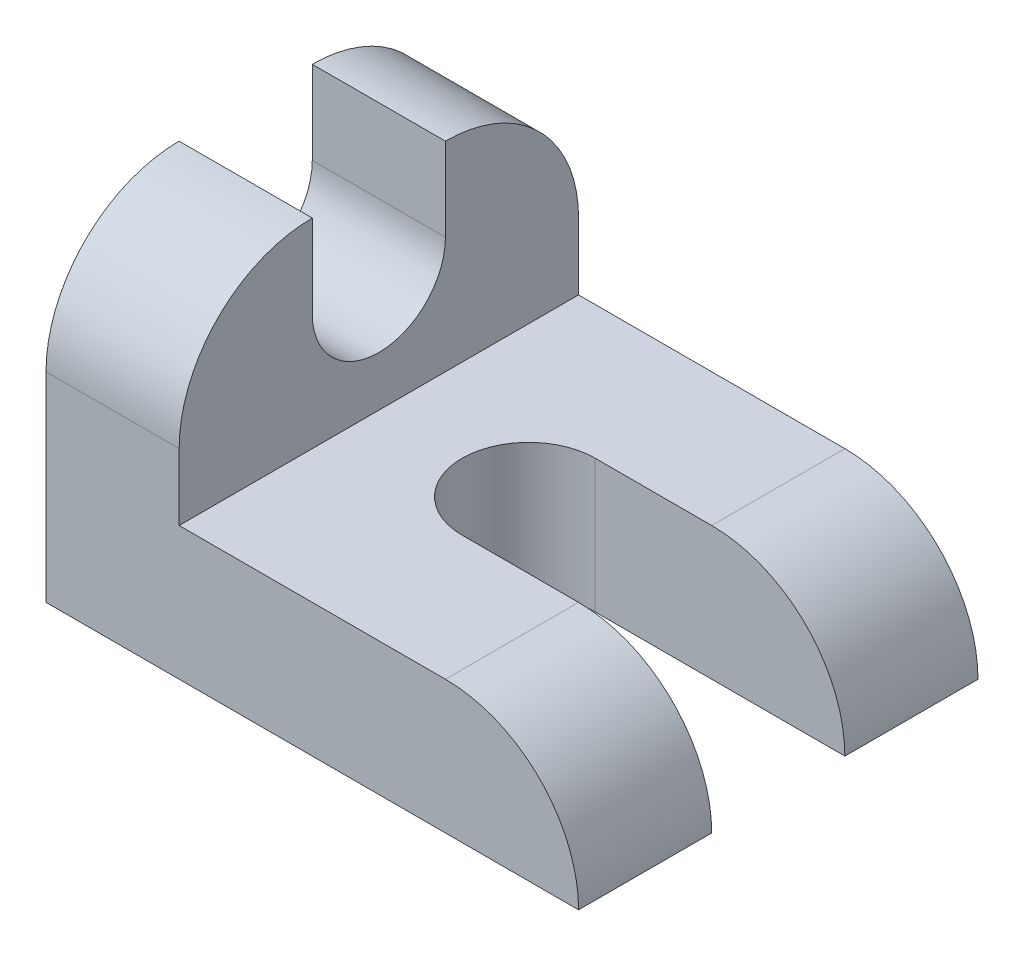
ISO-10303-21;
HEADER;
FILE_DESCRIPTION(('STEP AP214'),'2;1');
FILE_NAME('part.step','',(''),(''),'','','');
FILE_SCHEMA(('AUTOMOTIVE_DESIGN { 1 0 10303 214 1 1 1 1 }'));
ENDSEC;
DATA;
#1=APPLICATION_CONTEXT('core data for automotive mechanical design processes');
#2=APPLICATION_PROTOCOL_DEFINITION('international standard','automotive_design',2000,#1);
#3=PRODUCT_CONTEXT('',#1,'mechanical');
#4=PRODUCT('Part','Part','',(#3));
#5=PRODUCT_RELATED_PRODUCT_CATEGORY('part','',(#4));
#6=PRODUCT_DEFINITION_FORMATION('','',#4);
#7=PRODUCT_DEFINITION_CONTEXT('part definition',#1,'design');
#8=PRODUCT_DEFINITION('design','',#6,#7);
#9=PRODUCT_DEFINITION_SHAPE('','',#8);
#10=(LENGTH_UNIT() NAMED_UNIT(*) SI_UNIT(.MILLI.,.METRE.));
#11=(NAMED_UNIT(*) PLANE_ANGLE_UNIT() SI_UNIT($,.RADIAN.));
#12=(NAMED_UNIT(*) SI_UNIT($,.STERADIAN.) SOLID_ANGLE_UNIT());
#13=UNCERTAINTY_MEASURE_WITH_UNIT(LENGTH_MEASURE(1.E-05),#10,'distance_accuracy_value','');
#14=(GEOMETRIC_REPRESENTATION_CONTEXT(3) GLOBAL_UNCERTAINTY_ASSIGNED_CONTEXT((#13)) GLOBAL_UNIT_ASSIGNED_CONTEXT((#10,
#11,#12)) REPRESENTATION_CONTEXT('',''));
#15=CARTESIAN_POINT('',(0.,0.,0.));
#16=DIRECTION('',(0.,0.,1.));
#17=DIRECTION('',(1.,0.,0.));
#18=AXIS2_PLACEMENT_3D('',#15,#16,#17);
#19=CARTESIAN_POINT('',(152.4,0.,-76.2));
#20=DIRECTION('',(0.,0.,1.));
#21=DIRECTION('',(1.,0.,0.));
#22=AXIS2_PLACEMENT_3D('',#19,#20,#21);
#23=CYLINDRICAL_SURFACE('',#22,50.8);
#24=CARTESIAN_POINT('',(152.4,0.,-25.4));
#25=DIRECTION('',(0.,0.,-1.));
#26=DIRECTION('',(-1.,0.,0.));
#27=AXIS2_PLACEMENT_3D('',#24,#25,#26);
#28=CIRCLE('',#27,50.8);
#29=CARTESIAN_POINT('',(203.2,-5.6843418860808E-11,-25.4));
#30=VERTEX_POINT('',#29);
#31=CARTESIAN_POINT('',(152.4,50.8,-25.4));
#32=VERTEX_POINT('',#31);
#33=EDGE_CURVE('E40',#30,#32,#28,.F.);
#34=ORIENTED_EDGE('',*,*,#33,.F.);
#35=DIRECTION('',(0.,0.,1.));
#36=VECTOR('',#35,1.);
#37=CARTESIAN_POINT('',(203.2,0.,-76.2));
#38=LINE('',#37,#36);
#39=CARTESIAN_POINT('',(203.2,0.,-76.2));
#40=VERTEX_POINT('',#39);
#41=EDGE_CURVE('E157',#40,#30,#38,.T.);
#42=ORIENTED_EDGE('',*,*,#41,.F.);
#43=CARTESIAN_POINT('',(152.4,0.,-76.2));
#44=DIRECTION('',(0.,0.,-1.));
#45=DIRECTION('',(-1.,0.,0.));
#46=AXIS2_PLACEMENT_3D('',#43,#44,#45);
#47=CIRCLE('',#46,50.8);
#48=CARTESIAN_POINT('',(152.4,50.8,-76.2));
#49=VERTEX_POINT('',#48);
#50=EDGE_CURVE('E143',#49,#40,#47,.T.);
#51=ORIENTED_EDGE('',*,*,#50,.F.);
#52=DIRECTION('',(0.,0.,1.));
#53=VECTOR('',#52,1.);
#54=CARTESIAN_POINT('',(152.4,50.8,-76.2));
#55=LINE('',#54,#53);
#56=EDGE_CURVE('E55',#32,#49,#55,.F.);
#57=ORIENTED_EDGE('',*,*,#56,.F.);
#58=EDGE_LOOP('',(#34,#42,#51,#57));
#59=FACE_BOUND('',#58,.T.);
#60=ADVANCED_FACE('F32',(#59),#23,.T.);
#61=CARTESIAN_POINT('',(0.,0.,-76.2));
#62=DIRECTION('',(0.,-1.,0.));
#63=DIRECTION('',(0.,0.,-1.));
#64=AXIS2_PLACEMENT_3D('',#61,#62,#63);
#65=PLANE('',#64);
#66=DIRECTION('',(1.,0.,0.));
#67=VECTOR('',#66,1.);
#68=CARTESIAN_POINT('',(203.2,-5.6843418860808E-11,-25.4));
#69=LINE('',#68,#67);
#70=CARTESIAN_POINT('',(107.95,-5.6843418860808E-11,-25.4));
#71=VERTEX_POINT('',#70);
#72=EDGE_CURVE('E195',#71,#30,#69,.T.);
#73=ORIENTED_EDGE('',*,*,#72,.F.);
#74=CARTESIAN_POINT('',(107.95,-5.6843418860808E-11,0.));
#75=DIRECTION('',(0.,-1.,0.));
#76=DIRECTION('',(0.,0.,-1.));
#77=AXIS2_PLACEMENT_3D('',#74,#75,#76);
#78=CIRCLE('',#77,25.4);
#79=CARTESIAN_POINT('',(107.95,-5.6843418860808E-11,25.4));
#80=VERTEX_POINT('',#79);
#81=EDGE_CURVE('E152',#80,#71,#78,.T.);
#82=ORIENTED_EDGE('',*,*,#81,.F.);
#83=DIRECTION('',(-1.,0.,0.));
#84=VECTOR('',#83,1.);
#85=CARTESIAN_POINT('',(203.2,-5.6843418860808E-11,25.4));
#86=LINE('',#85,#84);
#87=CARTESIAN_POINT('',(203.2,-5.6843418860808E-11,25.4));
#88=VERTEX_POINT('',#87);
#89=EDGE_CURVE('E137',#88,#80,#86,.T.);
#90=ORIENTED_EDGE('',*,*,#89,.F.);
#91=CARTESIAN_POINT('',(203.2,0.,76.2));
#92=VERTEX_POINT('',#91);
#93=EDGE_CURVE('E149',#88,#92,#38,.T.);
#94=ORIENTED_EDGE('',*,*,#93,.T.);
#95=DIRECTION('',(1.,0.,0.));
#96=VECTOR('',#95,1.);
#97=CARTESIAN_POINT('',(0.,0.,76.2));
#98=LINE('',#97,#96);
#99=CARTESIAN_POINT('',(0.,0.,76.2));
#100=VERTEX_POINT('',#99);
#101=EDGE_CURVE('E221',#100,#92,#98,.T.);
#102=ORIENTED_EDGE('',*,*,#101,.F.);
#103=DIRECTION('',(0.,0.,1.));
#104=VECTOR('',#103,1.);
#105=CARTESIAN_POINT('',(0.,0.,-76.2));
#106=LINE('',#105,#104);
#107=CARTESIAN_POINT('',(0.,0.,-76.2));
#108=VERTEX_POINT('',#107);
#109=EDGE_CURVE('E170',#108,#100,#106,.T.);
#110=ORIENTED_EDGE('',*,*,#109,.F.);
#111=DIRECTION('',(1.,0.,0.));
#112=VECTOR('',#111,1.);
#113=CARTESIAN_POINT('',(0.,0.,-76.2));
#114=LINE('',#113,#112);
#115=EDGE_CURVE('E207',#108,#40,#114,.T.);
#116=ORIENTED_EDGE('',*,*,#115,.T.);
#117=ORIENTED_EDGE('',*,*,#41,.T.);
#118=EDGE_LOOP('',(#73,#82,#90,#94,#102,#110,#116,#117));
#119=FACE_BOUND('',#118,.T.);
#120=ADVANCED_FACE('F147',(#119),#65,.T.);
#121=CARTESIAN_POINT('',(0.,127.,-76.2));
#122=DIRECTION('',(-1.,0.,0.));
#123=DIRECTION('',(0.,-1.,0.));
#124=AXIS2_PLACEMENT_3D('',#121,#122,#123);
#125=PLANE('',#124);
#126=DIRECTION('',(0.,1.,0.));
#127=VECTOR('',#126,1.);
#128=CARTESIAN_POINT('',(0.,127.,-25.4));
#129=LINE('',#128,#127);
#130=CARTESIAN_POINT('',(0.,95.25,-25.4));
#131=VERTEX_POINT('',#130);
#132=CARTESIAN_POINT('',(0.,127.,-25.4));
#133=VERTEX_POINT('',#132);
#134=EDGE_CURVE('E260',#131,#133,#129,.T.);
#135=ORIENTED_EDGE('',*,*,#134,.T.);
#136=CARTESIAN_POINT('',(0.,76.2,-25.4));
#137=DIRECTION('',(-1.,0.,0.));
#138=DIRECTION('',(0.,-1.,0.));
#139=AXIS2_PLACEMENT_3D('',#136,#137,#138);
#140=CIRCLE('',#139,50.8);
#141=CARTESIAN_POINT('',(0.,76.2,-76.2));
#142=VERTEX_POINT('',#141);
#143=EDGE_CURVE('E180',#133,#142,#140,.T.);
#144=ORIENTED_EDGE('',*,*,#143,.T.);
#145=DIRECTION('',(0.,-1.,0.));
#146=VECTOR('',#145,1.);
#147=CARTESIAN_POINT('',(0.,127.,-76.2));
#148=LINE('',#147,#146);
#149=EDGE_CURVE('E158',#142,#108,#148,.T.);
#150=ORIENTED_EDGE('',*,*,#149,.T.);
#151=ORIENTED_EDGE('',*,*,#109,.T.);
#152=DIRECTION('',(0.,-1.,0.));
#153=VECTOR('',#152,1.);
#154=CARTESIAN_POINT('',(0.,127.,76.2));
#155=LINE('',#154,#153);
#156=CARTESIAN_POINT('',(0.,76.2,76.2));
#157=VERTEX_POINT('',#156);
#158=EDGE_CURVE('E211',#157,#100,#155,.T.);
#159=ORIENTED_EDGE('',*,*,#158,.F.);
#160=CARTESIAN_POINT('',(0.,76.2,25.4));
#161=DIRECTION('',(-1.,0.,0.));
#162=DIRECTION('',(0.,-1.,0.));
#163=AXIS2_PLACEMENT_3D('',#160,#161,#162);
#164=CIRCLE('',#163,50.8);
#165=CARTESIAN_POINT('',(0.,127.,25.4));
#166=VERTEX_POINT('',#165);
#167=EDGE_CURVE('E182',#157,#166,#164,.T.);
#168=ORIENTED_EDGE('',*,*,#167,.T.);
#169=DIRECTION('',(0.,-1.,0.));
#170=VECTOR('',#169,1.);
#171=CARTESIAN_POINT('',(0.,127.,25.4));
#172=LINE('',#171,#170);
#173=CARTESIAN_POINT('',(0.,95.25,25.4));
#174=VERTEX_POINT('',#173);
#175=EDGE_CURVE('E251',#166,#174,#172,.T.);
#176=ORIENTED_EDGE('',*,*,#175,.T.);
#177=CARTESIAN_POINT('',(0.,95.25,0.));
#178=DIRECTION('',(1.,0.,0.));
#179=DIRECTION('',(0.,1.,0.));
#180=AXIS2_PLACEMENT_3D('',#177,#178,#179);
#181=CIRCLE('',#180,25.4);
#182=EDGE_CURVE('E267',#174,#131,#181,.T.);
#183=ORIENTED_EDGE('',*,*,#182,.T.);
#184=EDGE_LOOP('',(#135,#144,#150,#151,#159,#168,#176,#183));
#185=FACE_BOUND('',#184,.T.);
#186=ADVANCED_FACE('F240',(#185),#125,.T.);
#187=CARTESIAN_POINT('',(50.8,127.,-76.2));
#188=DIRECTION('',(-1.,0.,0.));
#189=DIRECTION('',(0.,-1.,0.));
#190=AXIS2_PLACEMENT_3D('',#187,#188,#189);
#191=PLANE('',#190);
#192=CARTESIAN_POINT('',(50.8,76.2,-25.4));
#193=DIRECTION('',(-1.,0.,0.));
#194=DIRECTION('',(0.,-1.,0.));
#195=AXIS2_PLACEMENT_3D('',#192,#193,#194);
#196=CIRCLE('',#195,50.8);
#197=CARTESIAN_POINT('',(50.8,76.2,-76.2));
#198=VERTEX_POINT('',#197);
#199=CARTESIAN_POINT('',(50.8,127.,-25.4));
#200=VERTEX_POINT('',#199);
#201=EDGE_CURVE('E172',#198,#200,#196,.F.);
#202=ORIENTED_EDGE('',*,*,#201,.T.);
#203=DIRECTION('',(0.,1.,0.));
#204=VECTOR('',#203,1.);
#205=CARTESIAN_POINT('',(50.8,127.,-25.4));
#206=LINE('',#205,#204);
#207=CARTESIAN_POINT('',(50.8,95.25,-25.4));
#208=VERTEX_POINT('',#207);
#209=EDGE_CURVE('E257',#208,#200,#206,.T.);
#210=ORIENTED_EDGE('',*,*,#209,.F.);
#211=CARTESIAN_POINT('',(50.8,95.25,0.));
#212=DIRECTION('',(1.,0.,0.));
#213=DIRECTION('',(0.,1.,0.));
#214=AXIS2_PLACEMENT_3D('',#211,#212,#213);
#215=CIRCLE('',#214,25.4);
#216=CARTESIAN_POINT('',(50.8,95.25,25.4));
#217=VERTEX_POINT('',#216);
#218=EDGE_CURVE('E255',#217,#208,#215,.T.);
#219=ORIENTED_EDGE('',*,*,#218,.F.);
#220=DIRECTION('',(0.,-1.,0.));
#221=VECTOR('',#220,1.);
#222=CARTESIAN_POINT('',(50.8,127.,25.4));
#223=LINE('',#222,#221);
#224=CARTESIAN_POINT('',(50.8,127.,25.4));
#225=VERTEX_POINT('',#224);
#226=EDGE_CURVE('E199',#225,#217,#223,.T.);
#227=ORIENTED_EDGE('',*,*,#226,.F.);
#228=CARTESIAN_POINT('',(50.8,76.2,25.4));
#229=DIRECTION('',(-1.,0.,0.));
#230=DIRECTION('',(0.,-1.,0.));
#231=AXIS2_PLACEMENT_3D('',#228,#229,#230);
#232=CIRCLE('',#231,50.8);
#233=CARTESIAN_POINT('',(50.8,76.2,76.2));
#234=VERTEX_POINT('',#233);
#235=EDGE_CURVE('E175',#225,#234,#232,.F.);
#236=ORIENTED_EDGE('',*,*,#235,.T.);
#237=DIRECTION('',(0.,-1.,0.));
#238=VECTOR('',#237,1.);
#239=CARTESIAN_POINT('',(50.8,127.,76.2));
#240=LINE('',#239,#238);
#241=CARTESIAN_POINT('',(50.8,50.8,76.2));
#242=VERTEX_POINT('',#241);
#243=EDGE_CURVE('E214',#234,#242,#240,.T.);
#244=ORIENTED_EDGE('',*,*,#243,.T.);
#245=DIRECTION('',(0.,0.,1.));
#246=VECTOR('',#245,1.);
#247=CARTESIAN_POINT('',(50.8,50.8,-76.2));
#248=LINE('',#247,#246);
#249=CARTESIAN_POINT('',(50.8,50.8,-76.2));
#250=VERTEX_POINT('',#249);
#251=EDGE_CURVE('E161',#250,#242,#248,.T.);
#252=ORIENTED_EDGE('',*,*,#251,.F.);
#253=DIRECTION('',(0.,-1.,0.));
#254=VECTOR('',#253,1.);
#255=CARTESIAN_POINT('',(50.8,127.,-76.2));
#256=LINE('',#255,#254);
#257=EDGE_CURVE('E162',#198,#250,#256,.T.);
#258=ORIENTED_EDGE('',*,*,#257,.F.);
#259=EDGE_LOOP('',(#202,#210,#219,#227,#236,#244,#252,#258));
#260=FACE_BOUND('',#259,.T.);
#261=ADVANCED_FACE('F252',(#260),#191,.F.);
#262=CARTESIAN_POINT('',(0.,50.8,-76.2));
#263=DIRECTION('',(0.,-1.,0.));
#264=DIRECTION('',(0.,0.,-1.));
#265=AXIS2_PLACEMENT_3D('',#262,#263,#264);
#266=PLANE('',#265);
#267=CARTESIAN_POINT('',(107.95,50.8,0.));
#268=DIRECTION('',(0.,-1.,0.));
#269=DIRECTION('',(0.,0.,-1.));
#270=AXIS2_PLACEMENT_3D('',#267,#268,#269);
#271=CIRCLE('',#270,25.4);
#272=CARTESIAN_POINT('',(107.95,50.8,25.4));
#273=VERTEX_POINT('',#272);
#274=CARTESIAN_POINT('',(107.95,50.8,-25.4));
#275=VERTEX_POINT('',#274);
#276=EDGE_CURVE('E11',#273,#275,#271,.T.);
#277=ORIENTED_EDGE('',*,*,#276,.T.);
#278=DIRECTION('',(1.,0.,0.));
#279=VECTOR('',#278,1.);
#280=CARTESIAN_POINT('',(0.,50.8,-25.4));
#281=LINE('',#280,#279);
#282=EDGE_CURVE('E193',#275,#32,#281,.T.);
#283=ORIENTED_EDGE('',*,*,#282,.T.);
#284=ORIENTED_EDGE('',*,*,#56,.T.);
#285=DIRECTION('',(1.,0.,0.));
#286=VECTOR('',#285,1.);
#287=CARTESIAN_POINT('',(0.,50.8,-76.2));
#288=LINE('',#287,#286);
#289=EDGE_CURVE('E208',#250,#49,#288,.T.);
#290=ORIENTED_EDGE('',*,*,#289,.F.);
#291=ORIENTED_EDGE('',*,*,#251,.T.);
#292=DIRECTION('',(1.,0.,0.));
#293=VECTOR('',#292,1.);
#294=CARTESIAN_POINT('',(0.,50.8,76.2));
#295=LINE('',#294,#293);
#296=CARTESIAN_POINT('',(152.4,50.8,76.2));
#297=VERTEX_POINT('',#296);
#298=EDGE_CURVE('E223',#242,#297,#295,.T.);
#299=ORIENTED_EDGE('',*,*,#298,.T.);
#300=CARTESIAN_POINT('',(152.4,50.8,25.4));
#301=VERTEX_POINT('',#300);
#302=EDGE_CURVE('E185',#297,#301,#55,.F.);
#303=ORIENTED_EDGE('',*,*,#302,.T.);
#304=DIRECTION('',(-1.,0.,0.));
#305=VECTOR('',#304,1.);
#306=CARTESIAN_POINT('',(0.,50.8,25.4));
#307=LINE('',#306,#305);
#308=EDGE_CURVE('E47',#301,#273,#307,.T.);
#309=ORIENTED_EDGE('',*,*,#308,.T.);
#310=EDGE_LOOP('',(#277,#283,#284,#290,#291,#299,#303,#309));
#311=FACE_BOUND('',#310,.T.);
#312=ADVANCED_FACE('F198',(#311),#266,.F.);
#313=CARTESIAN_POINT('',(203.2,0.,-76.2));
#314=DIRECTION('',(0.,0.,-1.));
#315=DIRECTION('',(-1.,0.,0.));
#316=AXIS2_PLACEMENT_3D('',#313,#314,#315);
#317=PLANE('',#316);
#318=ORIENTED_EDGE('',*,*,#289,.T.);
#319=ORIENTED_EDGE('',*,*,#50,.T.);
#320=ORIENTED_EDGE('',*,*,#115,.F.);
#321=ORIENTED_EDGE('',*,*,#149,.F.);
#322=DIRECTION('',(1.,0.,0.));
#323=VECTOR('',#322,1.);
#324=CARTESIAN_POINT('',(50.8,76.2,-76.2));
#325=LINE('',#324,#323);
#326=EDGE_CURVE('E187',#142,#198,#325,.T.);
#327=ORIENTED_EDGE('',*,*,#326,.T.);
#328=ORIENTED_EDGE('',*,*,#257,.T.);
#329=EDGE_LOOP('',(#318,#319,#320,#321,#327,#328));
#330=FACE_BOUND('',#329,.T.);
#331=ADVANCED_FACE('F205',(#330),#317,.T.);
#332=CARTESIAN_POINT('',(203.2,0.,76.2));
#333=DIRECTION('',(0.,0.,-1.));
#334=DIRECTION('',(-1.,0.,0.));
#335=AXIS2_PLACEMENT_3D('',#332,#333,#334);
#336=PLANE('',#335);
#337=ORIENTED_EDGE('',*,*,#243,.F.);
#338=DIRECTION('',(1.,0.,0.));
#339=VECTOR('',#338,1.);
#340=CARTESIAN_POINT('',(203.2,76.2,76.2));
#341=LINE('',#340,#339);
#342=EDGE_CURVE('E178',#234,#157,#341,.F.);
#343=ORIENTED_EDGE('',*,*,#342,.T.);
#344=ORIENTED_EDGE('',*,*,#158,.T.);
#345=ORIENTED_EDGE('',*,*,#101,.T.);
#346=CARTESIAN_POINT('',(152.4,0.,76.2));
#347=DIRECTION('',(0.,0.,-1.));
#348=DIRECTION('',(-1.,0.,0.));
#349=AXIS2_PLACEMENT_3D('',#346,#347,#348);
#350=CIRCLE('',#349,50.8);
#351=EDGE_CURVE('E155',#92,#297,#350,.F.);
#352=ORIENTED_EDGE('',*,*,#351,.T.);
#353=ORIENTED_EDGE('',*,*,#298,.F.);
#354=EDGE_LOOP('',(#337,#343,#344,#345,#352,#353));
#355=FACE_BOUND('',#354,.T.);
#356=ADVANCED_FACE('F236',(#355),#336,.F.);
#357=CARTESIAN_POINT('',(0.,76.2,25.4));
#358=DIRECTION('',(1.,0.,0.));
#359=DIRECTION('',(0.,0.,-1.));
#360=AXIS2_PLACEMENT_3D('',#357,#358,#359);
#361=CYLINDRICAL_SURFACE('',#360,50.8);
#362=ORIENTED_EDGE('',*,*,#167,.F.);
#363=ORIENTED_EDGE('',*,*,#342,.F.);
#364=ORIENTED_EDGE('',*,*,#235,.F.);
#365=DIRECTION('',(1.,0.,0.));
#366=VECTOR('',#365,1.);
#367=CARTESIAN_POINT('',(0.,127.,25.4));
#368=LINE('',#367,#366);
#369=EDGE_CURVE('E169',#166,#225,#368,.T.);
#370=ORIENTED_EDGE('',*,*,#369,.F.);
#371=EDGE_LOOP('',(#362,#363,#364,#370));
#372=FACE_BOUND('',#371,.T.);
#373=ADVANCED_FACE('F244',(#372),#361,.T.);
#374=CARTESIAN_POINT('',(152.4,0.,25.4));
#375=DIRECTION('',(0.,0.,1.));
#376=DIRECTION('',(1.,0.,0.));
#377=AXIS2_PLACEMENT_3D('',#374,#375,#376);
#378=CIRCLE('',#377,50.8);
#379=EDGE_CURVE('E134',#301,#88,#378,.F.);
#380=ORIENTED_EDGE('',*,*,#379,.F.);
#381=ORIENTED_EDGE('',*,*,#302,.F.);
#382=ORIENTED_EDGE('',*,*,#351,.F.);
#383=ORIENTED_EDGE('',*,*,#93,.F.);
#384=EDGE_LOOP('',(#380,#381,#382,#383));
#385=FACE_BOUND('',#384,.T.);
#386=ADVANCED_FACE('F154',(#385),#23,.T.);
#387=CARTESIAN_POINT('',(203.2,76.2,-25.4));
#388=DIRECTION('',(-1.,0.,0.));
#389=DIRECTION('',(0.,0.,1.));
#390=AXIS2_PLACEMENT_3D('',#387,#388,#389);
#391=CYLINDRICAL_SURFACE('',#390,50.8);
#392=ORIENTED_EDGE('',*,*,#143,.F.);
#393=DIRECTION('',(1.,0.,0.));
#394=VECTOR('',#393,1.);
#395=CARTESIAN_POINT('',(0.,127.,-25.4));
#396=LINE('',#395,#394);
#397=EDGE_CURVE('E167',#200,#133,#396,.F.);
#398=ORIENTED_EDGE('',*,*,#397,.F.);
#399=ORIENTED_EDGE('',*,*,#201,.F.);
#400=ORIENTED_EDGE('',*,*,#326,.F.);
#401=EDGE_LOOP('',(#392,#398,#399,#400));
#402=FACE_BOUND('',#401,.T.);
#403=ADVANCED_FACE('F34',(#402),#391,.T.);
#404=CARTESIAN_POINT('',(0.,127.,-25.4));
#405=DIRECTION('',(0.,0.,-1.));
#406=DIRECTION('',(0.,1.,0.));
#407=AXIS2_PLACEMENT_3D('',#404,#405,#406);
#408=PLANE('',#407);
#409=ORIENTED_EDGE('',*,*,#209,.T.);
#410=ORIENTED_EDGE('',*,*,#397,.T.);
#411=ORIENTED_EDGE('',*,*,#134,.F.);
#412=DIRECTION('',(1.,0.,0.));
#413=VECTOR('',#412,1.);
#414=CARTESIAN_POINT('',(0.,95.25,-25.4));
#415=LINE('',#414,#413);
#416=EDGE_CURVE('E224',#131,#208,#415,.T.);
#417=ORIENTED_EDGE('',*,*,#416,.T.);
#418=EDGE_LOOP('',(#409,#410,#411,#417));
#419=FACE_BOUND('',#418,.T.);
#420=ADVANCED_FACE('F301',(#419),#408,.F.);
#421=CARTESIAN_POINT('',(0.,95.25,0.));
#422=DIRECTION('',(1.,0.,0.));
#423=DIRECTION('',(0.,1.,0.));
#424=AXIS2_PLACEMENT_3D('',#421,#422,#423);
#425=CYLINDRICAL_SURFACE('',#424,25.4);
#426=ORIENTED_EDGE('',*,*,#218,.T.);
#427=ORIENTED_EDGE('',*,*,#416,.F.);
#428=ORIENTED_EDGE('',*,*,#182,.F.);
#429=DIRECTION('',(1.,0.,0.));
#430=VECTOR('',#429,1.);
#431=CARTESIAN_POINT('',(0.,95.25,25.4));
#432=LINE('',#431,#430);
#433=EDGE_CURVE('E217',#174,#217,#432,.T.);
#434=ORIENTED_EDGE('',*,*,#433,.T.);
#435=EDGE_LOOP('',(#426,#427,#428,#434));
#436=FACE_BOUND('',#435,.T.);
#437=ADVANCED_FACE('F287',(#436),#425,.F.);
#438=CARTESIAN_POINT('',(0.,127.,25.4));
#439=DIRECTION('',(0.,0.,1.));
#440=DIRECTION('',(0.,-1.,0.));
#441=AXIS2_PLACEMENT_3D('',#438,#439,#440);
#442=PLANE('',#441);
#443=ORIENTED_EDGE('',*,*,#226,.T.);
#444=ORIENTED_EDGE('',*,*,#433,.F.);
#445=ORIENTED_EDGE('',*,*,#175,.F.);
#446=ORIENTED_EDGE('',*,*,#369,.T.);
#447=EDGE_LOOP('',(#443,#444,#445,#446));
#448=FACE_BOUND('',#447,.T.);
#449=ADVANCED_FACE('F249',(#448),#442,.F.);
#450=CARTESIAN_POINT('',(107.95,127.,0.));
#451=DIRECTION('',(0.,-1.,0.));
#452=DIRECTION('',(0.,0.,-1.));
#453=AXIS2_PLACEMENT_3D('',#450,#451,#452);
#454=CYLINDRICAL_SURFACE('',#453,25.4);
#455=DIRECTION('',(0.,-1.,0.));
#456=VECTOR('',#455,1.);
#457=CARTESIAN_POINT('',(107.95,127.,25.4));
#458=LINE('',#457,#456);
#459=EDGE_CURVE('E274',#273,#80,#458,.T.);
#460=ORIENTED_EDGE('',*,*,#459,.T.);
#461=ORIENTED_EDGE('',*,*,#81,.T.);
#462=DIRECTION('',(0.,-1.,0.));
#463=VECTOR('',#462,1.);
#464=CARTESIAN_POINT('',(107.95,127.,-25.4));
#465=LINE('',#464,#463);
#466=EDGE_CURVE('E273',#275,#71,#465,.T.);
#467=ORIENTED_EDGE('',*,*,#466,.F.);
#468=ORIENTED_EDGE('',*,*,#276,.F.);
#469=EDGE_LOOP('',(#460,#461,#467,#468));
#470=FACE_BOUND('',#469,.T.);
#471=ADVANCED_FACE('F279',(#470),#454,.F.);
#472=CARTESIAN_POINT('',(203.2,127.,-25.4));
#473=DIRECTION('',(0.,0.,-1.));
#474=DIRECTION('',(-1.,0.,0.));
#475=AXIS2_PLACEMENT_3D('',#472,#473,#474);
#476=PLANE('',#475);
#477=ORIENTED_EDGE('',*,*,#466,.T.);
#478=ORIENTED_EDGE('',*,*,#72,.T.);
#479=ORIENTED_EDGE('',*,*,#33,.T.);
#480=ORIENTED_EDGE('',*,*,#282,.F.);
#481=EDGE_LOOP('',(#477,#478,#479,#480));
#482=FACE_BOUND('',#481,.T.);
#483=ADVANCED_FACE('F192',(#482),#476,.F.);
#484=CARTESIAN_POINT('',(203.2,127.,25.4));
#485=DIRECTION('',(0.,0.,1.));
#486=DIRECTION('',(1.,0.,0.));
#487=AXIS2_PLACEMENT_3D('',#484,#485,#486);
#488=PLANE('',#487);
#489=ORIENTED_EDGE('',*,*,#379,.T.);
#490=ORIENTED_EDGE('',*,*,#89,.T.);
#491=ORIENTED_EDGE('',*,*,#459,.F.);
#492=ORIENTED_EDGE('',*,*,#308,.F.);
#493=EDGE_LOOP('',(#489,#490,#491,#492));
#494=FACE_BOUND('',#493,.T.);
#495=ADVANCED_FACE('F136',(#494),#488,.F.);
#496=CLOSED_SHELL('',(#60,#120,#186,#261,#312,#331,#356,#373,#386,#403,#420,#437,#449,#471,#483,#495));
#497=MANIFOLD_SOLID_BREP('B2',#496);
#498=ADVANCED_BREP_SHAPE_REPRESENTATION('',(#18,#497),#14);
#499=SHAPE_DEFINITION_REPRESENTATION(#9,#498);
ENDSEC;
END-ISO-10303-21;
